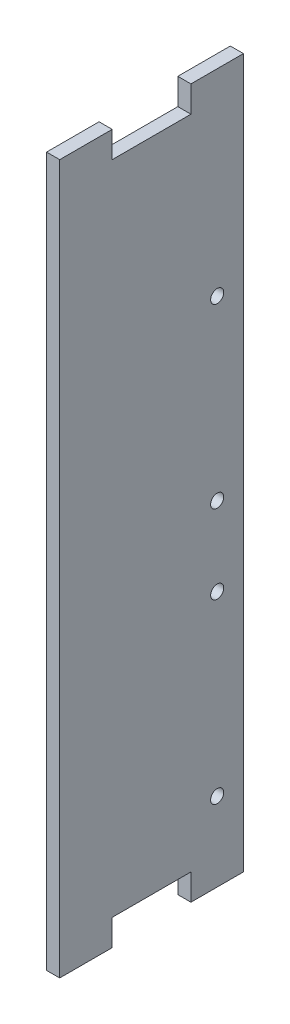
ISO-10303-21;
HEADER;
FILE_DESCRIPTION(('STEP AP214'),'2;1');
FILE_NAME('part.step','',(''),(''),'','','');
FILE_SCHEMA(('AUTOMOTIVE_DESIGN { 1 0 10303 214 1 1 1 1 }'));
ENDSEC;
DATA;
#1=APPLICATION_CONTEXT('core data for automotive mechanical design processes');
#2=APPLICATION_PROTOCOL_DEFINITION('international standard','automotive_design',2000,#1);
#3=PRODUCT_CONTEXT('',#1,'mechanical');
#4=PRODUCT('Part','Part','',(#3));
#5=PRODUCT_RELATED_PRODUCT_CATEGORY('part','',(#4));
#6=PRODUCT_DEFINITION_FORMATION('','',#4);
#7=PRODUCT_DEFINITION_CONTEXT('part definition',#1,'design');
#8=PRODUCT_DEFINITION('design','',#6,#7);
#9=PRODUCT_DEFINITION_SHAPE('','',#8);
#10=(LENGTH_UNIT() NAMED_UNIT(*) SI_UNIT(.MILLI.,.METRE.));
#11=(NAMED_UNIT(*) PLANE_ANGLE_UNIT() SI_UNIT($,.RADIAN.));
#12=(NAMED_UNIT(*) SI_UNIT($,.STERADIAN.) SOLID_ANGLE_UNIT());
#13=UNCERTAINTY_MEASURE_WITH_UNIT(LENGTH_MEASURE(1.E-05),#10,'distance_accuracy_value','');
#14=(GEOMETRIC_REPRESENTATION_CONTEXT(3) GLOBAL_UNCERTAINTY_ASSIGNED_CONTEXT((#13)) GLOBAL_UNIT_ASSIGNED_CONTEXT((#10,
#11,#12)) REPRESENTATION_CONTEXT('',''));
#15=CARTESIAN_POINT('',(0.,0.,0.));
#16=DIRECTION('',(0.,0.,1.));
#17=DIRECTION('',(1.,0.,0.));
#18=AXIS2_PLACEMENT_3D('',#15,#16,#17);
#19=CARTESIAN_POINT('',(3.175,-6.35,9.525));
#20=DIRECTION('',(-1.,0.,0.));
#21=DIRECTION('',(0.,0.,1.));
#22=AXIS2_PLACEMENT_3D('',#19,#20,#21);
#23=PLANE('',#22);
#24=CARTESIAN_POINT('',(3.175,74.6125,-15.875));
#25=DIRECTION('',(1.,0.,0.));
#26=DIRECTION('',(0.,0.,-1.));
#27=AXIS2_PLACEMENT_3D('',#24,#25,#26);
#28=CIRCLE('',#27,1.5875);
#29=CARTESIAN_POINT('',(3.175,74.6125,-17.4625));
#30=VERTEX_POINT('',#29);
#31=EDGE_CURVE('E290',#30,#30,#28,.T.);
#32=ORIENTED_EDGE('',*,*,#31,.F.);
#33=EDGE_LOOP('',(#32));
#34=FACE_BOUND('',#33,.T.);
#35=CARTESIAN_POINT('',(3.175,12.7,-15.875));
#36=DIRECTION('',(1.,0.,0.));
#37=DIRECTION('',(0.,0.,-1.));
#38=AXIS2_PLACEMENT_3D('',#35,#36,#37);
#39=CIRCLE('',#38,1.5875);
#40=CARTESIAN_POINT('',(3.175,12.7,-17.4625));
#41=VERTEX_POINT('',#40);
#42=EDGE_CURVE('E156',#41,#41,#39,.T.);
#43=ORIENTED_EDGE('',*,*,#42,.F.);
#44=EDGE_LOOP('',(#43));
#45=FACE_BOUND('',#44,.T.);
#46=DIRECTION('',(0.,1.,0.));
#47=VECTOR('',#46,1.);
#48=CARTESIAN_POINT('',(3.175,0.,9.525));
#49=LINE('',#48,#47);
#50=CARTESIAN_POINT('',(3.175,-6.35,9.525));
#51=VERTEX_POINT('',#50);
#52=CARTESIAN_POINT('',(3.175,0.,9.525));
#53=VERTEX_POINT('',#52);
#54=EDGE_CURVE('E175',#51,#53,#49,.T.);
#55=ORIENTED_EDGE('',*,*,#54,.T.);
#56=DIRECTION('',(0.,0.,-1.));
#57=VECTOR('',#56,1.);
#58=CARTESIAN_POINT('',(3.175,0.,9.525));
#59=LINE('',#58,#57);
#60=CARTESIAN_POINT('',(3.175,0.,-9.525));
#61=VERTEX_POINT('',#60);
#62=EDGE_CURVE('E103',#53,#61,#59,.T.);
#63=ORIENTED_EDGE('',*,*,#62,.T.);
#64=DIRECTION('',(0.,-1.,0.));
#65=VECTOR('',#64,1.);
#66=CARTESIAN_POINT('',(3.175,0.,-9.525));
#67=LINE('',#66,#65);
#68=CARTESIAN_POINT('',(3.175,-6.35,-9.525));
#69=VERTEX_POINT('',#68);
#70=EDGE_CURVE('E202',#61,#69,#67,.T.);
#71=ORIENTED_EDGE('',*,*,#70,.T.);
#72=DIRECTION('',(0.,0.,-1.));
#73=VECTOR('',#72,1.);
#74=CARTESIAN_POINT('',(3.175,-6.35,-9.525));
#75=LINE('',#74,#73);
#76=CARTESIAN_POINT('',(3.175,-6.35,-22.225));
#77=VERTEX_POINT('',#76);
#78=EDGE_CURVE('E221',#69,#77,#75,.T.);
#79=ORIENTED_EDGE('',*,*,#78,.T.);
#80=DIRECTION('',(0.,1.,0.));
#81=VECTOR('',#80,1.);
#82=CARTESIAN_POINT('',(3.175,-6.35,-22.225));
#83=LINE('',#82,#81);
#84=CARTESIAN_POINT('',(3.175,165.1,-22.225));
#85=VERTEX_POINT('',#84);
#86=EDGE_CURVE('E218',#77,#85,#83,.T.);
#87=ORIENTED_EDGE('',*,*,#86,.T.);
#88=DIRECTION('',(0.,0.,1.));
#89=VECTOR('',#88,1.);
#90=CARTESIAN_POINT('',(3.175,165.1,-22.225));
#91=LINE('',#90,#89);
#92=CARTESIAN_POINT('',(3.175,165.1,-9.52500000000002));
#93=VERTEX_POINT('',#92);
#94=EDGE_CURVE('E220',#85,#93,#91,.T.);
#95=ORIENTED_EDGE('',*,*,#94,.T.);
#96=DIRECTION('',(0.,-1.,0.));
#97=VECTOR('',#96,1.);
#98=CARTESIAN_POINT('',(3.175,165.1,-9.52500000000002));
#99=LINE('',#98,#97);
#100=CARTESIAN_POINT('',(3.175,158.75,-9.52500000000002));
#101=VERTEX_POINT('',#100);
#102=EDGE_CURVE('E223',#93,#101,#99,.T.);
#103=ORIENTED_EDGE('',*,*,#102,.T.);
#104=DIRECTION('',(0.,0.,1.));
#105=VECTOR('',#104,1.);
#106=CARTESIAN_POINT('',(3.175,158.75,9.52500000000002));
#107=LINE('',#106,#105);
#108=CARTESIAN_POINT('',(3.175,158.75,9.52500000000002));
#109=VERTEX_POINT('',#108);
#110=EDGE_CURVE('E229',#101,#109,#107,.T.);
#111=ORIENTED_EDGE('',*,*,#110,.T.);
#112=DIRECTION('',(0.,1.,0.));
#113=VECTOR('',#112,1.);
#114=CARTESIAN_POINT('',(3.175,165.1,9.52500000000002));
#115=LINE('',#114,#113);
#116=CARTESIAN_POINT('',(3.175,165.1,9.52500000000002));
#117=VERTEX_POINT('',#116);
#118=EDGE_CURVE('E134',#109,#117,#115,.T.);
#119=ORIENTED_EDGE('',*,*,#118,.T.);
#120=DIRECTION('',(0.,0.,1.));
#121=VECTOR('',#120,1.);
#122=CARTESIAN_POINT('',(3.175,165.1,22.225));
#123=LINE('',#122,#121);
#124=CARTESIAN_POINT('',(3.175,165.1,22.225));
#125=VERTEX_POINT('',#124);
#126=EDGE_CURVE('E128',#117,#125,#123,.T.);
#127=ORIENTED_EDGE('',*,*,#126,.T.);
#128=DIRECTION('',(0.,-1.,0.));
#129=VECTOR('',#128,1.);
#130=CARTESIAN_POINT('',(3.175,-6.35,22.225));
#131=LINE('',#130,#129);
#132=CARTESIAN_POINT('',(3.175,-6.35,22.225));
#133=VERTEX_POINT('',#132);
#134=EDGE_CURVE('E132',#125,#133,#131,.T.);
#135=ORIENTED_EDGE('',*,*,#134,.T.);
#136=DIRECTION('',(0.,0.,-1.));
#137=VECTOR('',#136,1.);
#138=CARTESIAN_POINT('',(3.175,-6.35,9.525));
#139=LINE('',#138,#137);
#140=EDGE_CURVE('E48',#133,#51,#139,.T.);
#141=ORIENTED_EDGE('',*,*,#140,.T.);
#142=EDGE_LOOP('',(#55,#63,#71,#79,#87,#95,#103,#111,#119,#127,#135,#141));
#143=FACE_BOUND('',#142,.T.);
#144=CARTESIAN_POINT('',(3.175,55.5625,-15.875));
#145=DIRECTION('',(1.,0.,0.));
#146=DIRECTION('',(0.,0.,-1.));
#147=AXIS2_PLACEMENT_3D('',#144,#145,#146);
#148=CIRCLE('',#147,1.5875);
#149=CARTESIAN_POINT('',(3.175,55.5625,-17.4625));
#150=VERTEX_POINT('',#149);
#151=EDGE_CURVE('E296',#150,#150,#148,.T.);
#152=ORIENTED_EDGE('',*,*,#151,.F.);
#153=EDGE_LOOP('',(#152));
#154=FACE_BOUND('',#153,.T.);
#155=CARTESIAN_POINT('',(3.175,117.475,-15.875));
#156=DIRECTION('',(1.,0.,0.));
#157=DIRECTION('',(0.,0.,-1.));
#158=AXIS2_PLACEMENT_3D('',#155,#156,#157);
#159=CIRCLE('',#158,1.5875);
#160=CARTESIAN_POINT('',(3.175,117.475,-17.4625));
#161=VERTEX_POINT('',#160);
#162=EDGE_CURVE('E281',#161,#161,#159,.T.);
#163=ORIENTED_EDGE('',*,*,#162,.F.);
#164=EDGE_LOOP('',(#163));
#165=FACE_BOUND('',#164,.T.);
#166=ADVANCED_FACE('F31',(#34,#45,#143,#154,#165),#23,.F.);
#167=CARTESIAN_POINT('',(0.,-6.35,9.525));
#168=DIRECTION('',(-1.,0.,0.));
#169=DIRECTION('',(0.,0.,1.));
#170=AXIS2_PLACEMENT_3D('',#167,#168,#169);
#171=PLANE('',#170);
#172=CARTESIAN_POINT('',(0.,74.6125,-15.875));
#173=DIRECTION('',(1.,0.,0.));
#174=DIRECTION('',(0.,0.,-1.));
#175=AXIS2_PLACEMENT_3D('',#172,#173,#174);
#176=CIRCLE('',#175,1.5875);
#177=CARTESIAN_POINT('',(0.,74.6125,-17.4625));
#178=VERTEX_POINT('',#177);
#179=EDGE_CURVE('E287',#178,#178,#176,.T.);
#180=ORIENTED_EDGE('',*,*,#179,.T.);
#181=EDGE_LOOP('',(#180));
#182=FACE_BOUND('',#181,.T.);
#183=CARTESIAN_POINT('',(0.,12.7,-15.875));
#184=DIRECTION('',(1.,0.,0.));
#185=DIRECTION('',(0.,0.,-1.));
#186=AXIS2_PLACEMENT_3D('',#183,#184,#185);
#187=CIRCLE('',#186,1.5875);
#188=CARTESIAN_POINT('',(0.,12.7,-17.4625));
#189=VERTEX_POINT('',#188);
#190=EDGE_CURVE('E299',#189,#189,#187,.T.);
#191=ORIENTED_EDGE('',*,*,#190,.T.);
#192=EDGE_LOOP('',(#191));
#193=FACE_BOUND('',#192,.T.);
#194=DIRECTION('',(0.,1.,0.));
#195=VECTOR('',#194,1.);
#196=CARTESIAN_POINT('',(0.,0.,9.525));
#197=LINE('',#196,#195);
#198=CARTESIAN_POINT('',(0.,-6.35,9.525));
#199=VERTEX_POINT('',#198);
#200=CARTESIAN_POINT('',(0.,0.,9.525));
#201=VERTEX_POINT('',#200);
#202=EDGE_CURVE('E152',#199,#201,#197,.T.);
#203=ORIENTED_EDGE('',*,*,#202,.F.);
#204=DIRECTION('',(0.,0.,-1.));
#205=VECTOR('',#204,1.);
#206=CARTESIAN_POINT('',(0.,-6.35,9.525));
#207=LINE('',#206,#205);
#208=CARTESIAN_POINT('',(0.,-6.35,22.225));
#209=VERTEX_POINT('',#208);
#210=EDGE_CURVE('E95',#209,#199,#207,.T.);
#211=ORIENTED_EDGE('',*,*,#210,.F.);
#212=DIRECTION('',(0.,-1.,0.));
#213=VECTOR('',#212,1.);
#214=CARTESIAN_POINT('',(0.,-6.35,22.225));
#215=LINE('',#214,#213);
#216=CARTESIAN_POINT('',(0.,165.1,22.225));
#217=VERTEX_POINT('',#216);
#218=EDGE_CURVE('E89',#217,#209,#215,.T.);
#219=ORIENTED_EDGE('',*,*,#218,.F.);
#220=DIRECTION('',(0.,0.,1.));
#221=VECTOR('',#220,1.);
#222=CARTESIAN_POINT('',(0.,165.1,22.225));
#223=LINE('',#222,#221);
#224=CARTESIAN_POINT('',(0.,165.1,9.52500000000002));
#225=VERTEX_POINT('',#224);
#226=EDGE_CURVE('E142',#225,#217,#223,.T.);
#227=ORIENTED_EDGE('',*,*,#226,.F.);
#228=DIRECTION('',(0.,1.,0.));
#229=VECTOR('',#228,1.);
#230=CARTESIAN_POINT('',(0.,165.1,9.52500000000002));
#231=LINE('',#230,#229);
#232=CARTESIAN_POINT('',(0.,158.75,9.52500000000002));
#233=VERTEX_POINT('',#232);
#234=EDGE_CURVE('E170',#233,#225,#231,.T.);
#235=ORIENTED_EDGE('',*,*,#234,.F.);
#236=DIRECTION('',(0.,0.,1.));
#237=VECTOR('',#236,1.);
#238=CARTESIAN_POINT('',(0.,158.75,9.52500000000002));
#239=LINE('',#238,#237);
#240=CARTESIAN_POINT('',(0.,158.75,-9.52500000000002));
#241=VERTEX_POINT('',#240);
#242=EDGE_CURVE('E168',#241,#233,#239,.T.);
#243=ORIENTED_EDGE('',*,*,#242,.F.);
#244=DIRECTION('',(0.,-1.,0.));
#245=VECTOR('',#244,1.);
#246=CARTESIAN_POINT('',(0.,165.1,-9.52500000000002));
#247=LINE('',#246,#245);
#248=CARTESIAN_POINT('',(0.,165.1,-9.52500000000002));
#249=VERTEX_POINT('',#248);
#250=EDGE_CURVE('E166',#249,#241,#247,.T.);
#251=ORIENTED_EDGE('',*,*,#250,.F.);
#252=DIRECTION('',(0.,0.,1.));
#253=VECTOR('',#252,1.);
#254=CARTESIAN_POINT('',(0.,165.1,-22.225));
#255=LINE('',#254,#253);
#256=CARTESIAN_POINT('',(0.,165.1,-22.225));
#257=VERTEX_POINT('',#256);
#258=EDGE_CURVE('E164',#257,#249,#255,.T.);
#259=ORIENTED_EDGE('',*,*,#258,.F.);
#260=DIRECTION('',(0.,1.,0.));
#261=VECTOR('',#260,1.);
#262=CARTESIAN_POINT('',(0.,-6.35,-22.225));
#263=LINE('',#262,#261);
#264=CARTESIAN_POINT('',(0.,-6.35,-22.225));
#265=VERTEX_POINT('',#264);
#266=EDGE_CURVE('E162',#265,#257,#263,.T.);
#267=ORIENTED_EDGE('',*,*,#266,.F.);
#268=DIRECTION('',(0.,0.,-1.));
#269=VECTOR('',#268,1.);
#270=CARTESIAN_POINT('',(0.,-6.35,-9.525));
#271=LINE('',#270,#269);
#272=CARTESIAN_POINT('',(0.,-6.35,-9.525));
#273=VERTEX_POINT('',#272);
#274=EDGE_CURVE('E160',#273,#265,#271,.T.);
#275=ORIENTED_EDGE('',*,*,#274,.F.);
#276=DIRECTION('',(0.,-1.,0.));
#277=VECTOR('',#276,1.);
#278=CARTESIAN_POINT('',(0.,0.,-9.525));
#279=LINE('',#278,#277);
#280=CARTESIAN_POINT('',(0.,0.,-9.525));
#281=VERTEX_POINT('',#280);
#282=EDGE_CURVE('E158',#281,#273,#279,.T.);
#283=ORIENTED_EDGE('',*,*,#282,.F.);
#284=DIRECTION('',(0.,0.,-1.));
#285=VECTOR('',#284,1.);
#286=CARTESIAN_POINT('',(0.,0.,9.525));
#287=LINE('',#286,#285);
#288=EDGE_CURVE('E155',#201,#281,#287,.T.);
#289=ORIENTED_EDGE('',*,*,#288,.F.);
#290=EDGE_LOOP('',(#203,#211,#219,#227,#235,#243,#251,#259,#267,#275,#283,#289));
#291=FACE_BOUND('',#290,.T.);
#292=CARTESIAN_POINT('',(0.,55.5625,-15.875));
#293=DIRECTION('',(1.,0.,0.));
#294=DIRECTION('',(0.,0.,-1.));
#295=AXIS2_PLACEMENT_3D('',#292,#293,#294);
#296=CIRCLE('',#295,1.5875);
#297=CARTESIAN_POINT('',(0.,55.5625,-17.4625));
#298=VERTEX_POINT('',#297);
#299=EDGE_CURVE('E293',#298,#298,#296,.T.);
#300=ORIENTED_EDGE('',*,*,#299,.T.);
#301=EDGE_LOOP('',(#300));
#302=FACE_BOUND('',#301,.T.);
#303=CARTESIAN_POINT('',(0.,117.475,-15.875));
#304=DIRECTION('',(1.,0.,0.));
#305=DIRECTION('',(0.,0.,-1.));
#306=AXIS2_PLACEMENT_3D('',#303,#304,#305);
#307=CIRCLE('',#306,1.5875);
#308=CARTESIAN_POINT('',(0.,117.475,-17.4625));
#309=VERTEX_POINT('',#308);
#310=EDGE_CURVE('E284',#309,#309,#307,.T.);
#311=ORIENTED_EDGE('',*,*,#310,.T.);
#312=EDGE_LOOP('',(#311));
#313=FACE_BOUND('',#312,.T.);
#314=ADVANCED_FACE('F206',(#182,#193,#291,#302,#313),#171,.T.);
#315=CARTESIAN_POINT('',(3.175,0.,9.525));
#316=DIRECTION('',(0.,0.,1.));
#317=DIRECTION('',(0.,-1.,0.));
#318=AXIS2_PLACEMENT_3D('',#315,#316,#317);
#319=PLANE('',#318);
#320=ORIENTED_EDGE('',*,*,#202,.T.);
#321=DIRECTION('',(-1.,0.,0.));
#322=VECTOR('',#321,1.);
#323=CARTESIAN_POINT('',(3.175,0.,9.525));
#324=LINE('',#323,#322);
#325=EDGE_CURVE('E11',#53,#201,#324,.T.);
#326=ORIENTED_EDGE('',*,*,#325,.F.);
#327=ORIENTED_EDGE('',*,*,#54,.F.);
#328=DIRECTION('',(-1.,0.,0.));
#329=VECTOR('',#328,1.);
#330=CARTESIAN_POINT('',(3.175,-6.35,9.525));
#331=LINE('',#330,#329);
#332=EDGE_CURVE('E148',#51,#199,#331,.T.);
#333=ORIENTED_EDGE('',*,*,#332,.T.);
#334=EDGE_LOOP('',(#320,#326,#327,#333));
#335=FACE_BOUND('',#334,.T.);
#336=ADVANCED_FACE('F33',(#335),#319,.F.);
#337=CARTESIAN_POINT('',(3.175,0.,9.525));
#338=DIRECTION('',(0.,1.,0.));
#339=DIRECTION('',(0.,0.,1.));
#340=AXIS2_PLACEMENT_3D('',#337,#338,#339);
#341=PLANE('',#340);
#342=ORIENTED_EDGE('',*,*,#288,.T.);
#343=DIRECTION('',(-1.,0.,0.));
#344=VECTOR('',#343,1.);
#345=CARTESIAN_POINT('',(3.175,0.,-9.525));
#346=LINE('',#345,#344);
#347=EDGE_CURVE('E40',#61,#281,#346,.T.);
#348=ORIENTED_EDGE('',*,*,#347,.F.);
#349=ORIENTED_EDGE('',*,*,#62,.F.);
#350=ORIENTED_EDGE('',*,*,#325,.T.);
#351=EDGE_LOOP('',(#342,#348,#349,#350));
#352=FACE_BOUND('',#351,.T.);
#353=ADVANCED_FACE('F408',(#352),#341,.F.);
#354=CARTESIAN_POINT('',(3.175,0.,-9.525));
#355=DIRECTION('',(0.,0.,-1.));
#356=DIRECTION('',(0.,1.,0.));
#357=AXIS2_PLACEMENT_3D('',#354,#355,#356);
#358=PLANE('',#357);
#359=ORIENTED_EDGE('',*,*,#282,.T.);
#360=DIRECTION('',(-1.,0.,0.));
#361=VECTOR('',#360,1.);
#362=CARTESIAN_POINT('',(3.175,-6.35,-9.525));
#363=LINE('',#362,#361);
#364=EDGE_CURVE('E194',#69,#273,#363,.T.);
#365=ORIENTED_EDGE('',*,*,#364,.F.);
#366=ORIENTED_EDGE('',*,*,#70,.F.);
#367=ORIENTED_EDGE('',*,*,#347,.T.);
#368=EDGE_LOOP('',(#359,#365,#366,#367));
#369=FACE_BOUND('',#368,.T.);
#370=ADVANCED_FACE('F200',(#369),#358,.F.);
#371=CARTESIAN_POINT('',(3.175,-6.35,-9.525));
#372=DIRECTION('',(0.,1.,0.));
#373=DIRECTION('',(0.,0.,1.));
#374=AXIS2_PLACEMENT_3D('',#371,#372,#373);
#375=PLANE('',#374);
#376=ORIENTED_EDGE('',*,*,#274,.T.);
#377=DIRECTION('',(-1.,0.,0.));
#378=VECTOR('',#377,1.);
#379=CARTESIAN_POINT('',(3.175,-6.35,-22.225));
#380=LINE('',#379,#378);
#381=EDGE_CURVE('E191',#77,#265,#380,.T.);
#382=ORIENTED_EDGE('',*,*,#381,.F.);
#383=ORIENTED_EDGE('',*,*,#78,.F.);
#384=ORIENTED_EDGE('',*,*,#364,.T.);
#385=EDGE_LOOP('',(#376,#382,#383,#384));
#386=FACE_BOUND('',#385,.T.);
#387=ADVANCED_FACE('F212',(#386),#375,.F.);
#388=CARTESIAN_POINT('',(3.175,-6.35,-22.225));
#389=DIRECTION('',(0.,0.,1.));
#390=DIRECTION('',(1.,0.,0.));
#391=AXIS2_PLACEMENT_3D('',#388,#389,#390);
#392=PLANE('',#391);
#393=ORIENTED_EDGE('',*,*,#266,.T.);
#394=DIRECTION('',(-1.,0.,0.));
#395=VECTOR('',#394,1.);
#396=CARTESIAN_POINT('',(3.175,165.1,-22.225));
#397=LINE('',#396,#395);
#398=EDGE_CURVE('E188',#85,#257,#397,.T.);
#399=ORIENTED_EDGE('',*,*,#398,.F.);
#400=ORIENTED_EDGE('',*,*,#86,.F.);
#401=ORIENTED_EDGE('',*,*,#381,.T.);
#402=EDGE_LOOP('',(#393,#399,#400,#401));
#403=FACE_BOUND('',#402,.T.);
#404=ADVANCED_FACE('F216',(#403),#392,.F.);
#405=CARTESIAN_POINT('',(3.175,165.1,-22.225));
#406=DIRECTION('',(0.,-1.,0.));
#407=DIRECTION('',(0.,0.,-1.));
#408=AXIS2_PLACEMENT_3D('',#405,#406,#407);
#409=PLANE('',#408);
#410=ORIENTED_EDGE('',*,*,#258,.T.);
#411=DIRECTION('',(-1.,0.,0.));
#412=VECTOR('',#411,1.);
#413=CARTESIAN_POINT('',(3.175,165.1,-9.52500000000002));
#414=LINE('',#413,#412);
#415=EDGE_CURVE('E185',#93,#249,#414,.T.);
#416=ORIENTED_EDGE('',*,*,#415,.F.);
#417=ORIENTED_EDGE('',*,*,#94,.F.);
#418=ORIENTED_EDGE('',*,*,#398,.T.);
#419=EDGE_LOOP('',(#410,#416,#417,#418));
#420=FACE_BOUND('',#419,.T.);
#421=ADVANCED_FACE('F373',(#420),#409,.F.);
#422=CARTESIAN_POINT('',(3.175,165.1,-9.52500000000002));
#423=DIRECTION('',(0.,0.,-1.));
#424=DIRECTION('',(-1.,0.,0.));
#425=AXIS2_PLACEMENT_3D('',#422,#423,#424);
#426=PLANE('',#425);
#427=ORIENTED_EDGE('',*,*,#250,.T.);
#428=DIRECTION('',(-1.,0.,0.));
#429=VECTOR('',#428,1.);
#430=CARTESIAN_POINT('',(3.175,158.75,-9.52500000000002));
#431=LINE('',#430,#429);
#432=EDGE_CURVE('E182',#101,#241,#431,.T.);
#433=ORIENTED_EDGE('',*,*,#432,.F.);
#434=ORIENTED_EDGE('',*,*,#102,.F.);
#435=ORIENTED_EDGE('',*,*,#415,.T.);
#436=EDGE_LOOP('',(#427,#433,#434,#435));
#437=FACE_BOUND('',#436,.T.);
#438=ADVANCED_FACE('F364',(#437),#426,.F.);
#439=CARTESIAN_POINT('',(3.175,158.75,9.52500000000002));
#440=DIRECTION('',(0.,-1.,0.));
#441=DIRECTION('',(0.,0.,-1.));
#442=AXIS2_PLACEMENT_3D('',#439,#440,#441);
#443=PLANE('',#442);
#444=ORIENTED_EDGE('',*,*,#242,.T.);
#445=DIRECTION('',(-1.,0.,0.));
#446=VECTOR('',#445,1.);
#447=CARTESIAN_POINT('',(3.175,158.75,9.52500000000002));
#448=LINE('',#447,#446);
#449=EDGE_CURVE('E179',#109,#233,#448,.T.);
#450=ORIENTED_EDGE('',*,*,#449,.F.);
#451=ORIENTED_EDGE('',*,*,#110,.F.);
#452=ORIENTED_EDGE('',*,*,#432,.T.);
#453=EDGE_LOOP('',(#444,#450,#451,#452));
#454=FACE_BOUND('',#453,.T.);
#455=ADVANCED_FACE('F235',(#454),#443,.F.);
#456=CARTESIAN_POINT('',(3.175,165.1,9.52500000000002));
#457=DIRECTION('',(0.,0.,1.));
#458=DIRECTION('',(1.,0.,0.));
#459=AXIS2_PLACEMENT_3D('',#456,#457,#458);
#460=PLANE('',#459);
#461=ORIENTED_EDGE('',*,*,#234,.T.);
#462=DIRECTION('',(-1.,0.,0.));
#463=VECTOR('',#462,1.);
#464=CARTESIAN_POINT('',(3.175,165.1,9.52500000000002));
#465=LINE('',#464,#463);
#466=EDGE_CURVE('E143',#117,#225,#465,.T.);
#467=ORIENTED_EDGE('',*,*,#466,.F.);
#468=ORIENTED_EDGE('',*,*,#118,.F.);
#469=ORIENTED_EDGE('',*,*,#449,.T.);
#470=EDGE_LOOP('',(#461,#467,#468,#469));
#471=FACE_BOUND('',#470,.T.);
#472=ADVANCED_FACE('F239',(#471),#460,.F.);
#473=CARTESIAN_POINT('',(3.175,165.1,22.225));
#474=DIRECTION('',(0.,-1.,0.));
#475=DIRECTION('',(0.,0.,-1.));
#476=AXIS2_PLACEMENT_3D('',#473,#474,#475);
#477=PLANE('',#476);
#478=ORIENTED_EDGE('',*,*,#226,.T.);
#479=DIRECTION('',(-1.,0.,0.));
#480=VECTOR('',#479,1.);
#481=CARTESIAN_POINT('',(3.175,165.1,22.225));
#482=LINE('',#481,#480);
#483=EDGE_CURVE('E139',#125,#217,#482,.T.);
#484=ORIENTED_EDGE('',*,*,#483,.F.);
#485=ORIENTED_EDGE('',*,*,#126,.F.);
#486=ORIENTED_EDGE('',*,*,#466,.T.);
#487=EDGE_LOOP('',(#478,#484,#485,#486));
#488=FACE_BOUND('',#487,.T.);
#489=ADVANCED_FACE('F140',(#488),#477,.F.);
#490=CARTESIAN_POINT('',(3.175,-6.35,22.225));
#491=DIRECTION('',(0.,0.,-1.));
#492=DIRECTION('',(-1.,0.,0.));
#493=AXIS2_PLACEMENT_3D('',#490,#491,#492);
#494=PLANE('',#493);
#495=ORIENTED_EDGE('',*,*,#218,.T.);
#496=DIRECTION('',(-1.,0.,0.));
#497=VECTOR('',#496,1.);
#498=CARTESIAN_POINT('',(3.175,-6.35,22.225));
#499=LINE('',#498,#497);
#500=EDGE_CURVE('E144',#133,#209,#499,.T.);
#501=ORIENTED_EDGE('',*,*,#500,.F.);
#502=ORIENTED_EDGE('',*,*,#134,.F.);
#503=ORIENTED_EDGE('',*,*,#483,.T.);
#504=EDGE_LOOP('',(#495,#501,#502,#503));
#505=FACE_BOUND('',#504,.T.);
#506=ADVANCED_FACE('F146',(#505),#494,.F.);
#507=CARTESIAN_POINT('',(3.175,-6.35,9.525));
#508=DIRECTION('',(0.,1.,0.));
#509=DIRECTION('',(0.,0.,1.));
#510=AXIS2_PLACEMENT_3D('',#507,#508,#509);
#511=PLANE('',#510);
#512=ORIENTED_EDGE('',*,*,#210,.T.);
#513=ORIENTED_EDGE('',*,*,#332,.F.);
#514=ORIENTED_EDGE('',*,*,#140,.F.);
#515=ORIENTED_EDGE('',*,*,#500,.T.);
#516=EDGE_LOOP('',(#512,#513,#514,#515));
#517=FACE_BOUND('',#516,.T.);
#518=ADVANCED_FACE('F243',(#517),#511,.F.);
#519=CARTESIAN_POINT('',(3.175,12.7,-15.875));
#520=DIRECTION('',(-1.,0.,0.));
#521=DIRECTION('',(0.,0.,1.));
#522=AXIS2_PLACEMENT_3D('',#519,#520,#521);
#523=CYLINDRICAL_SURFACE('',#522,1.5875);
#524=ORIENTED_EDGE('',*,*,#42,.T.);
#525=EDGE_LOOP('',(#524));
#526=FACE_BOUND('',#525,.T.);
#527=ORIENTED_EDGE('',*,*,#190,.F.);
#528=EDGE_LOOP('',(#527));
#529=FACE_BOUND('',#528,.T.);
#530=ADVANCED_FACE('F245',(#526,#529),#523,.F.);
#531=CARTESIAN_POINT('',(3.175,55.5625,-15.875));
#532=DIRECTION('',(-1.,0.,0.));
#533=DIRECTION('',(0.,0.,1.));
#534=AXIS2_PLACEMENT_3D('',#531,#532,#533);
#535=CYLINDRICAL_SURFACE('',#534,1.5875);
#536=ORIENTED_EDGE('',*,*,#151,.T.);
#537=EDGE_LOOP('',(#536));
#538=FACE_BOUND('',#537,.T.);
#539=ORIENTED_EDGE('',*,*,#299,.F.);
#540=EDGE_LOOP('',(#539));
#541=FACE_BOUND('',#540,.T.);
#542=ADVANCED_FACE('F251',(#538,#541),#535,.F.);
#543=CARTESIAN_POINT('',(3.175,74.6125,-15.875));
#544=DIRECTION('',(-1.,0.,0.));
#545=DIRECTION('',(0.,0.,1.));
#546=AXIS2_PLACEMENT_3D('',#543,#544,#545);
#547=CYLINDRICAL_SURFACE('',#546,1.5875);
#548=ORIENTED_EDGE('',*,*,#31,.T.);
#549=EDGE_LOOP('',(#548));
#550=FACE_BOUND('',#549,.T.);
#551=ORIENTED_EDGE('',*,*,#179,.F.);
#552=EDGE_LOOP('',(#551));
#553=FACE_BOUND('',#552,.T.);
#554=ADVANCED_FACE('F268',(#550,#553),#547,.F.);
#555=CARTESIAN_POINT('',(3.175,117.475,-15.875));
#556=DIRECTION('',(-1.,0.,0.));
#557=DIRECTION('',(0.,0.,1.));
#558=AXIS2_PLACEMENT_3D('',#555,#556,#557);
#559=CYLINDRICAL_SURFACE('',#558,1.5875);
#560=ORIENTED_EDGE('',*,*,#162,.T.);
#561=EDGE_LOOP('',(#560));
#562=FACE_BOUND('',#561,.T.);
#563=ORIENTED_EDGE('',*,*,#310,.F.);
#564=EDGE_LOOP('',(#563));
#565=FACE_BOUND('',#564,.T.);
#566=ADVANCED_FACE('F272',(#562,#565),#559,.F.);
#567=CLOSED_SHELL('',(#166,#314,#336,#353,#370,#387,#404,#421,#438,#455,#472,#489,#506,#518,
#530,#542,#554,#566));
#568=MANIFOLD_SOLID_BREP('B2',#567);
#569=ADVANCED_BREP_SHAPE_REPRESENTATION('',(#18,#568),#14);
#570=SHAPE_DEFINITION_REPRESENTATION(#9,#569);
ENDSEC;
END-ISO-10303-21;
